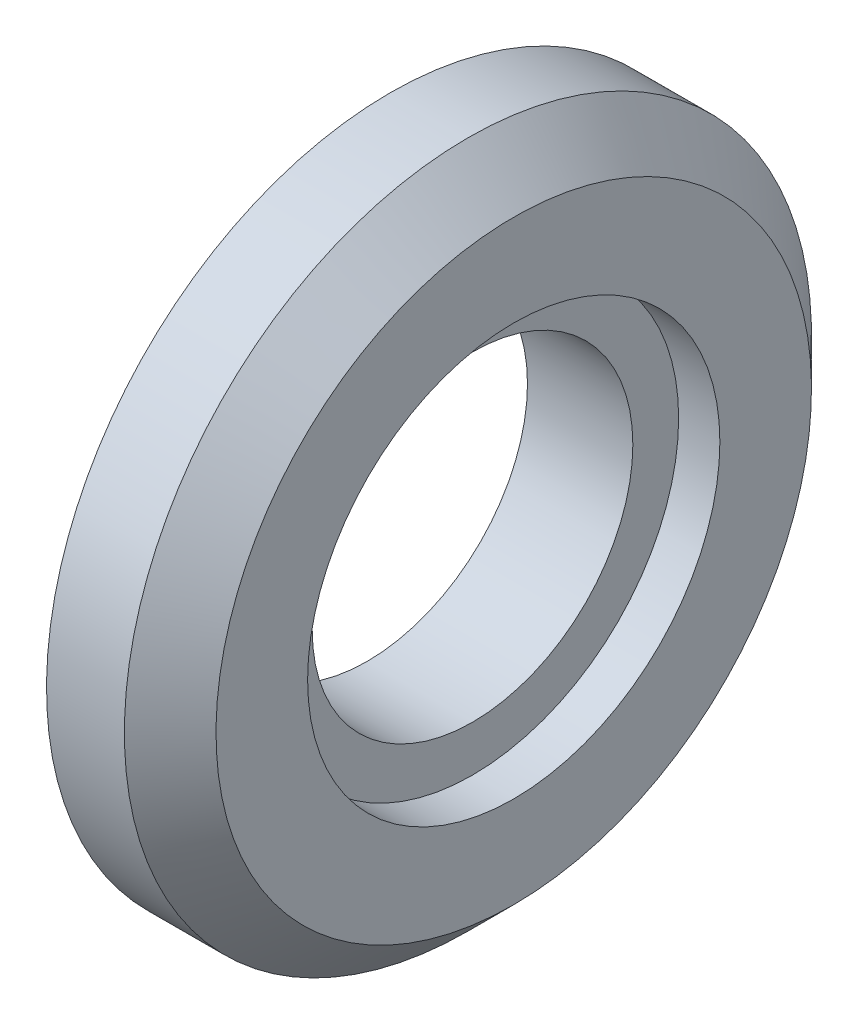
ISO-10303-21;
HEADER;
FILE_DESCRIPTION(('STEP AP214'),'2;1');
FILE_NAME('part.step','',(''),(''),'','','');
FILE_SCHEMA(('AUTOMOTIVE_DESIGN { 1 0 10303 214 1 1 1 1 }'));
ENDSEC;
DATA;
#1=APPLICATION_CONTEXT('core data for automotive mechanical design processes');
#2=APPLICATION_PROTOCOL_DEFINITION('international standard','automotive_design',2000,#1);
#3=PRODUCT_CONTEXT('',#1,'mechanical');
#4=PRODUCT('Part','Part','',(#3));
#5=PRODUCT_RELATED_PRODUCT_CATEGORY('part','',(#4));
#6=PRODUCT_DEFINITION_FORMATION('','',#4);
#7=PRODUCT_DEFINITION_CONTEXT('part definition',#1,'design');
#8=PRODUCT_DEFINITION('design','',#6,#7);
#9=PRODUCT_DEFINITION_SHAPE('','',#8);
#10=(LENGTH_UNIT() NAMED_UNIT(*) SI_UNIT(.MILLI.,.METRE.));
#11=(NAMED_UNIT(*) PLANE_ANGLE_UNIT() SI_UNIT($,.RADIAN.));
#12=(NAMED_UNIT(*) SI_UNIT($,.STERADIAN.) SOLID_ANGLE_UNIT());
#13=UNCERTAINTY_MEASURE_WITH_UNIT(LENGTH_MEASURE(1.E-05),#10,'distance_accuracy_value','');
#14=(GEOMETRIC_REPRESENTATION_CONTEXT(3) GLOBAL_UNCERTAINTY_ASSIGNED_CONTEXT((#13)) GLOBAL_UNIT_ASSIGNED_CONTEXT((#10,
#11,#12)) REPRESENTATION_CONTEXT('',''));
#15=CARTESIAN_POINT('',(0.,0.,0.));
#16=DIRECTION('',(0.,0.,1.));
#17=DIRECTION('',(1.,0.,0.));
#18=AXIS2_PLACEMENT_3D('',#15,#16,#17);
#19=CARTESIAN_POINT('',(-29.,-48.8161554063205,0.));
#20=DIRECTION('',(1.,0.,0.));
#21=DIRECTION('',(0.,1.,0.));
#22=AXIS2_PLACEMENT_3D('',#19,#20,#21);
#23=CYLINDRICAL_SURFACE('',#22,55.);
#24=CARTESIAN_POINT('',(-31.,-48.8161554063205,0.));
#25=DIRECTION('',(1.,0.,0.));
#26=DIRECTION('',(0.,1.,0.));
#27=AXIS2_PLACEMENT_3D('',#24,#25,#26);
#28=CIRCLE('',#27,55.);
#29=CARTESIAN_POINT('',(-31.,6.18384459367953,0.));
#30=VERTEX_POINT('',#29);
#31=EDGE_CURVE('E54',#30,#30,#28,.T.);
#32=ORIENTED_EDGE('',*,*,#31,.F.);
#33=EDGE_LOOP('',(#32));
#34=FACE_BOUND('',#33,.T.);
#35=CARTESIAN_POINT('',(-27.,-48.8161554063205,0.));
#36=DIRECTION('',(1.,0.,0.));
#37=DIRECTION('',(0.,1.,0.));
#38=AXIS2_PLACEMENT_3D('',#35,#36,#37);
#39=CIRCLE('',#38,55.);
#40=CARTESIAN_POINT('',(-27.,6.18384459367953,0.));
#41=VERTEX_POINT('',#40);
#42=EDGE_CURVE('E18',#41,#41,#39,.F.);
#43=ORIENTED_EDGE('',*,*,#42,.F.);
#44=EDGE_LOOP('',(#43));
#45=FACE_BOUND('',#44,.T.);
#46=ADVANCED_FACE('F14',(#34,#45),#23,.F.);
#47=CARTESIAN_POINT('',(-27.,1.18384459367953,0.));
#48=DIRECTION('',(-1.,0.,0.));
#49=DIRECTION('',(0.,0.,1.));
#50=AXIS2_PLACEMENT_3D('',#47,#48,#49);
#51=PLANE('',#50);
#52=CARTESIAN_POINT('',(-27.,-48.8161554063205,0.));
#53=DIRECTION('',(1.,0.,0.));
#54=DIRECTION('',(0.,1.,0.));
#55=AXIS2_PLACEMENT_3D('',#52,#53,#54);
#56=CIRCLE('',#55,45.);
#57=CARTESIAN_POINT('',(-27.,-3.81615540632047,0.));
#58=VERTEX_POINT('',#57);
#59=EDGE_CURVE('E52',#58,#58,#56,.F.);
#60=ORIENTED_EDGE('',*,*,#59,.F.);
#61=EDGE_LOOP('',(#60));
#62=FACE_BOUND('',#61,.T.);
#63=ORIENTED_EDGE('',*,*,#42,.T.);
#64=EDGE_LOOP('',(#63));
#65=FACE_BOUND('',#64,.T.);
#66=ADVANCED_FACE('F61',(#62,#65),#51,.T.);
#67=CARTESIAN_POINT('',(-31.,8.68384459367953,0.));
#68=DIRECTION('',(-1.,0.,0.));
#69=DIRECTION('',(0.,0.,1.));
#70=AXIS2_PLACEMENT_3D('',#67,#68,#69);
#71=PLANE('',#70);
#72=ORIENTED_EDGE('',*,*,#31,.T.);
#73=EDGE_LOOP('',(#72));
#74=FACE_BOUND('',#73,.T.);
#75=CARTESIAN_POINT('',(-31.,-48.8161554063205,0.));
#76=DIRECTION('',(1.,0.,0.));
#77=DIRECTION('',(0.,1.,0.));
#78=AXIS2_PLACEMENT_3D('',#75,#76,#77);
#79=CIRCLE('',#78,60.);
#80=CARTESIAN_POINT('',(-31.,11.1838445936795,0.));
#81=VERTEX_POINT('',#80);
#82=EDGE_CURVE('E49',#81,#81,#79,.T.);
#83=ORIENTED_EDGE('',*,*,#82,.F.);
#84=EDGE_LOOP('',(#83));
#85=FACE_BOUND('',#84,.T.);
#86=ADVANCED_FACE('F69',(#74,#85),#71,.T.);
#87=CARTESIAN_POINT('',(-29.5,-48.8161554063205,0.));
#88=DIRECTION('',(1.,0.,0.));
#89=DIRECTION('',(0.,1.,0.));
#90=AXIS2_PLACEMENT_3D('',#87,#88,#89);
#91=CYLINDRICAL_SURFACE('',#90,45.);
#92=ORIENTED_EDGE('',*,*,#59,.T.);
#93=EDGE_LOOP('',(#92));
#94=FACE_BOUND('',#93,.T.);
#95=CARTESIAN_POINT('',(-32.,-48.8161554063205,0.));
#96=DIRECTION('',(1.,0.,0.));
#97=DIRECTION('',(0.,1.,0.));
#98=AXIS2_PLACEMENT_3D('',#95,#96,#97);
#99=CIRCLE('',#98,45.);
#100=CARTESIAN_POINT('',(-32.,-3.81615540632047,0.));
#101=VERTEX_POINT('',#100);
#102=EDGE_CURVE('E46',#101,#101,#99,.F.);
#103=ORIENTED_EDGE('',*,*,#102,.F.);
#104=EDGE_LOOP('',(#103));
#105=FACE_BOUND('',#104,.T.);
#106=ADVANCED_FACE('F124',(#94,#105),#91,.T.);
#107=CARTESIAN_POINT('',(-29.,-48.8161554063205,0.));
#108=DIRECTION('',(1.,0.,0.));
#109=DIRECTION('',(0.,1.,0.));
#110=AXIS2_PLACEMENT_3D('',#107,#108,#109);
#111=CYLINDRICAL_SURFACE('',#110,60.);
#112=CARTESIAN_POINT('',(-27.,-48.8161554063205,0.));
#113=DIRECTION('',(1.,0.,0.));
#114=DIRECTION('',(0.,1.,0.));
#115=AXIS2_PLACEMENT_3D('',#112,#113,#114);
#116=CIRCLE('',#115,60.);
#117=CARTESIAN_POINT('',(-27.,11.1838445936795,0.));
#118=VERTEX_POINT('',#117);
#119=EDGE_CURVE('E43',#118,#118,#116,.T.);
#120=ORIENTED_EDGE('',*,*,#119,.F.);
#121=EDGE_LOOP('',(#120));
#122=FACE_BOUND('',#121,.T.);
#123=ORIENTED_EDGE('',*,*,#82,.T.);
#124=EDGE_LOOP('',(#123));
#125=FACE_BOUND('',#124,.T.);
#126=ADVANCED_FACE('F105',(#122,#125),#111,.T.);
#127=CARTESIAN_POINT('',(-32.,-8.81615540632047,0.));
#128=DIRECTION('',(-1.,0.,0.));
#129=DIRECTION('',(0.,0.,1.));
#130=AXIS2_PLACEMENT_3D('',#127,#128,#129);
#131=PLANE('',#130);
#132=CARTESIAN_POINT('',(-32.,-48.8161554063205,0.));
#133=DIRECTION('',(1.,0.,0.));
#134=DIRECTION('',(0.,1.,0.));
#135=AXIS2_PLACEMENT_3D('',#132,#133,#134);
#136=CIRCLE('',#135,35.);
#137=CARTESIAN_POINT('',(-32.,-13.8161554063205,0.));
#138=VERTEX_POINT('',#137);
#139=EDGE_CURVE('E40',#138,#138,#136,.T.);
#140=ORIENTED_EDGE('',*,*,#139,.T.);
#141=EDGE_LOOP('',(#140));
#142=FACE_BOUND('',#141,.T.);
#143=ORIENTED_EDGE('',*,*,#102,.T.);
#144=EDGE_LOOP('',(#143));
#145=FACE_BOUND('',#144,.T.);
#146=ADVANCED_FACE('F97',(#142,#145),#131,.T.);
#147=CARTESIAN_POINT('',(-27.,18.6838445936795,0.));
#148=DIRECTION('',(-1.,0.,0.));
#149=DIRECTION('',(0.,0.,1.));
#150=AXIS2_PLACEMENT_3D('',#147,#148,#149);
#151=PLANE('',#150);
#152=ORIENTED_EDGE('',*,*,#119,.T.);
#153=EDGE_LOOP('',(#152));
#154=FACE_BOUND('',#153,.T.);
#155=CARTESIAN_POINT('',(-27.,-48.8161554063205,0.));
#156=DIRECTION('',(1.,0.,0.));
#157=DIRECTION('',(0.,1.,0.));
#158=AXIS2_PLACEMENT_3D('',#155,#156,#157);
#159=CIRCLE('',#158,75.);
#160=CARTESIAN_POINT('',(-27.,26.1838445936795,0.));
#161=VERTEX_POINT('',#160);
#162=EDGE_CURVE('E37',#161,#161,#159,.T.);
#163=ORIENTED_EDGE('',*,*,#162,.F.);
#164=EDGE_LOOP('',(#163));
#165=FACE_BOUND('',#164,.T.);
#166=ADVANCED_FACE('F95',(#154,#165),#151,.T.);
#167=CARTESIAN_POINT('',(-23.8690806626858,-48.8161554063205,0.));
#168=DIRECTION('',(1.,0.,0.));
#169=DIRECTION('',(0.,1.,0.));
#170=AXIS2_PLACEMENT_3D('',#167,#168,#169);
#171=CYLINDRICAL_SURFACE('',#170,35.);
#172=ORIENTED_EDGE('',*,*,#139,.F.);
#173=EDGE_LOOP('',(#172));
#174=FACE_BOUND('',#173,.T.);
#175=CARTESIAN_POINT('',(-8.99999999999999,-48.8161554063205,0.));
#176=DIRECTION('',(1.,0.,0.));
#177=DIRECTION('',(0.,1.,0.));
#178=AXIS2_PLACEMENT_3D('',#175,#176,#177);
#179=CIRCLE('',#178,35.);
#180=CARTESIAN_POINT('',(-9.,-13.8161554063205,0.));
#181=VERTEX_POINT('',#180);
#182=EDGE_CURVE('E34',#181,#181,#179,.F.);
#183=ORIENTED_EDGE('',*,*,#182,.F.);
#184=EDGE_LOOP('',(#183));
#185=FACE_BOUND('',#184,.T.);
#186=ADVANCED_FACE('F91',(#174,#185),#171,.F.);
#187=CARTESIAN_POINT('',(-18.5,-48.8161554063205,0.));
#188=DIRECTION('',(1.,0.,0.));
#189=DIRECTION('',(0.,1.,0.));
#190=AXIS2_PLACEMENT_3D('',#187,#188,#189);
#191=CYLINDRICAL_SURFACE('',#190,75.);
#192=CARTESIAN_POINT('',(-10.0000000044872,-48.8161554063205,0.));
#193=DIRECTION('',(-1.,0.,0.));
#194=DIRECTION('',(0.,1.,0.));
#195=AXIS2_PLACEMENT_3D('',#192,#193,#194);
#196=CIRCLE('',#195,74.9999999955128);
#197=CARTESIAN_POINT('',(-10.0000000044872,26.1838445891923,0.));
#198=VERTEX_POINT('',#197);
#199=EDGE_CURVE('E30',#198,#198,#196,.F.);
#200=ORIENTED_EDGE('',*,*,#199,.F.);
#201=EDGE_LOOP('',(#200));
#202=FACE_BOUND('',#201,.T.);
#203=ORIENTED_EDGE('',*,*,#162,.T.);
#204=EDGE_LOOP('',(#203));
#205=FACE_BOUND('',#204,.T.);
#206=ADVANCED_FACE('F88',(#202,#205),#191,.T.);
#207=CARTESIAN_POINT('',(-9.,-8.81615540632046,0.));
#208=DIRECTION('',(1.,0.,0.));
#209=DIRECTION('',(0.,0.,-1.));
#210=AXIS2_PLACEMENT_3D('',#207,#208,#209);
#211=PLANE('',#210);
#212=ORIENTED_EDGE('',*,*,#182,.T.);
#213=EDGE_LOOP('',(#212));
#214=FACE_BOUND('',#213,.T.);
#215=CARTESIAN_POINT('',(-8.99999999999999,-48.8161554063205,0.));
#216=DIRECTION('',(1.,0.,0.));
#217=DIRECTION('',(0.,1.,0.));
#218=AXIS2_PLACEMENT_3D('',#215,#216,#217);
#219=CIRCLE('',#218,45.);
#220=CARTESIAN_POINT('',(-9.,-3.81615540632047,0.));
#221=VERTEX_POINT('',#220);
#222=EDGE_CURVE('E27',#221,#221,#219,.T.);
#223=ORIENTED_EDGE('',*,*,#222,.T.);
#224=EDGE_LOOP('',(#223));
#225=FACE_BOUND('',#224,.T.);
#226=ADVANCED_FACE('F83',(#214,#225),#211,.T.);
#227=CARTESIAN_POINT('',(-10.0000000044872,-48.8161554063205,0.));
#228=DIRECTION('',(-1.,0.,0.));
#229=DIRECTION('',(0.,-1.,0.));
#230=AXIS2_PLACEMENT_3D('',#227,#228,#229);
#231=CONICAL_SURFACE('',#230,74.9999999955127,0.7853981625);
#232=CARTESIAN_POINT('',(4.48725605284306E-09,-48.8161554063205,0.));
#233=DIRECTION('',(-1.,0.,0.));
#234=DIRECTION('',(0.,-1.,0.));
#235=AXIS2_PLACEMENT_3D('',#232,#233,#234);
#236=CIRCLE('',#235,65.0000000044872);
#237=CARTESIAN_POINT('',(4.4872725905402E-09,-113.816155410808,0.));
#238=VERTEX_POINT('',#237);
#239=EDGE_CURVE('E22',#238,#238,#236,.F.);
#240=ORIENTED_EDGE('',*,*,#239,.F.);
#241=EDGE_LOOP('',(#240));
#242=FACE_BOUND('',#241,.T.);
#243=ORIENTED_EDGE('',*,*,#199,.T.);
#244=EDGE_LOOP('',(#243));
#245=FACE_BOUND('',#244,.T.);
#246=ADVANCED_FACE('F76',(#242,#245),#231,.T.);
#247=CARTESIAN_POINT('',(-4.49999999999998,-48.8161554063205,0.));
#248=DIRECTION('',(1.,0.,0.));
#249=DIRECTION('',(0.,1.,0.));
#250=AXIS2_PLACEMENT_3D('',#247,#248,#249);
#251=CYLINDRICAL_SURFACE('',#250,45.);
#252=ORIENTED_EDGE('',*,*,#222,.F.);
#253=EDGE_LOOP('',(#252));
#254=FACE_BOUND('',#253,.T.);
#255=CARTESIAN_POINT('',(0.,-48.8161554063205,0.));
#256=DIRECTION('',(1.,0.,0.));
#257=DIRECTION('',(0.,1.,0.));
#258=AXIS2_PLACEMENT_3D('',#255,#256,#257);
#259=CIRCLE('',#258,45.);
#260=CARTESIAN_POINT('',(0.,-3.81615540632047,0.));
#261=VERTEX_POINT('',#260);
#262=EDGE_CURVE('E9',#261,#261,#259,.F.);
#263=ORIENTED_EDGE('',*,*,#262,.F.);
#264=EDGE_LOOP('',(#263));
#265=FACE_BOUND('',#264,.T.);
#266=ADVANCED_FACE('F73',(#254,#265),#251,.F.);
#267=CARTESIAN_POINT('',(0.,6.18384459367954,0.));
#268=DIRECTION('',(1.,0.,0.));
#269=DIRECTION('',(0.,0.,-1.));
#270=AXIS2_PLACEMENT_3D('',#267,#268,#269);
#271=PLANE('',#270);
#272=ORIENTED_EDGE('',*,*,#262,.T.);
#273=EDGE_LOOP('',(#272));
#274=FACE_BOUND('',#273,.T.);
#275=ORIENTED_EDGE('',*,*,#239,.T.);
#276=EDGE_LOOP('',(#275));
#277=FACE_BOUND('',#276,.T.);
#278=ADVANCED_FACE('F16',(#274,#277),#271,.T.);
#279=CLOSED_SHELL('',(#46,#66,#86,#106,#126,#146,#166,#186,#206,#226,#246,#266,#278));
#280=MANIFOLD_SOLID_BREP('B1',#279);
#281=ADVANCED_BREP_SHAPE_REPRESENTATION('',(#18,#280),#14);
#282=SHAPE_DEFINITION_REPRESENTATION(#9,#281);
ENDSEC;
END-ISO-10303-21;
